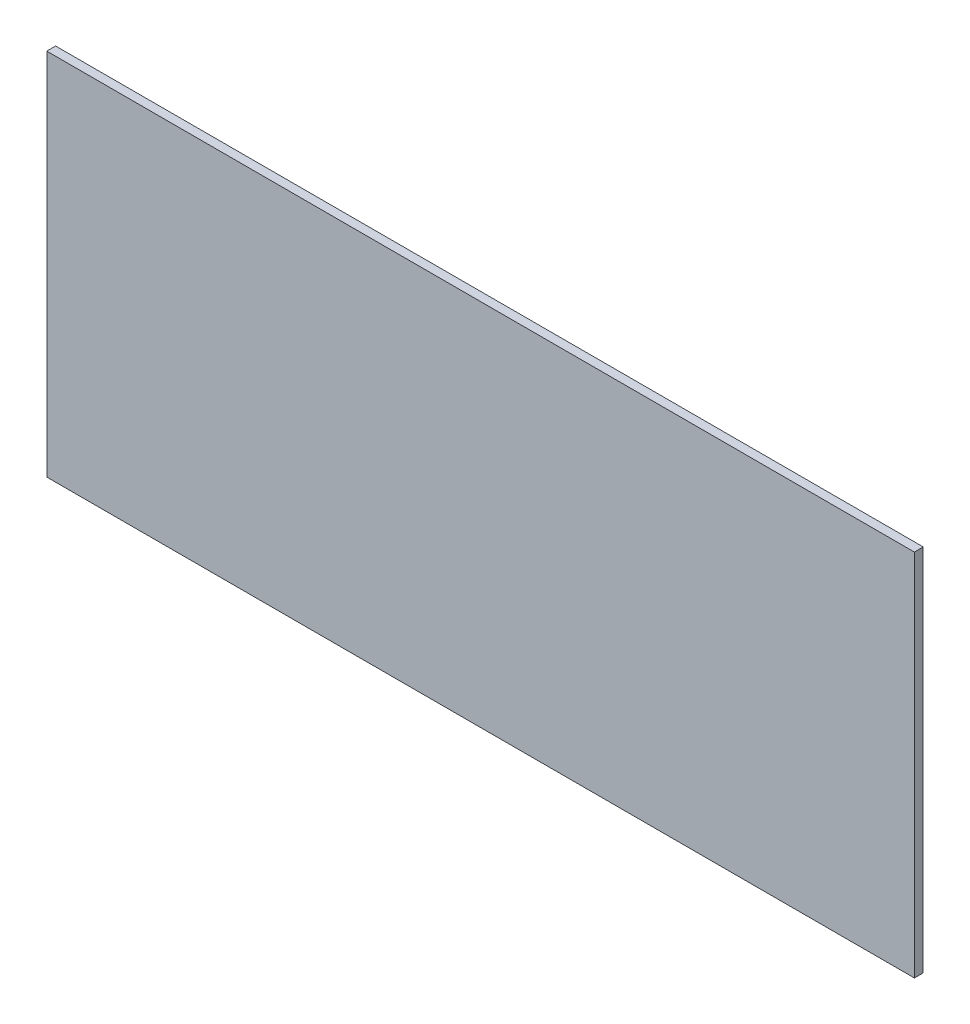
from build123d import *

# Parameters (mm, degrees)
ESBO_O1_W                = 588
ESBO_O1_H                = 250
RESSALTO_EXTRUS_O1_DEPTH = 6


with BuildPart() as part:
    # Esbo_o1 → Ressalto-extrus_o1 (new body)
    with BuildSketch(Plane.XY):
        Rectangle(ESBO_O1_W, ESBO_O1_H)
    extrude(amount=RESSALTO_EXTRUS_O1_DEPTH)


solid = part.part
